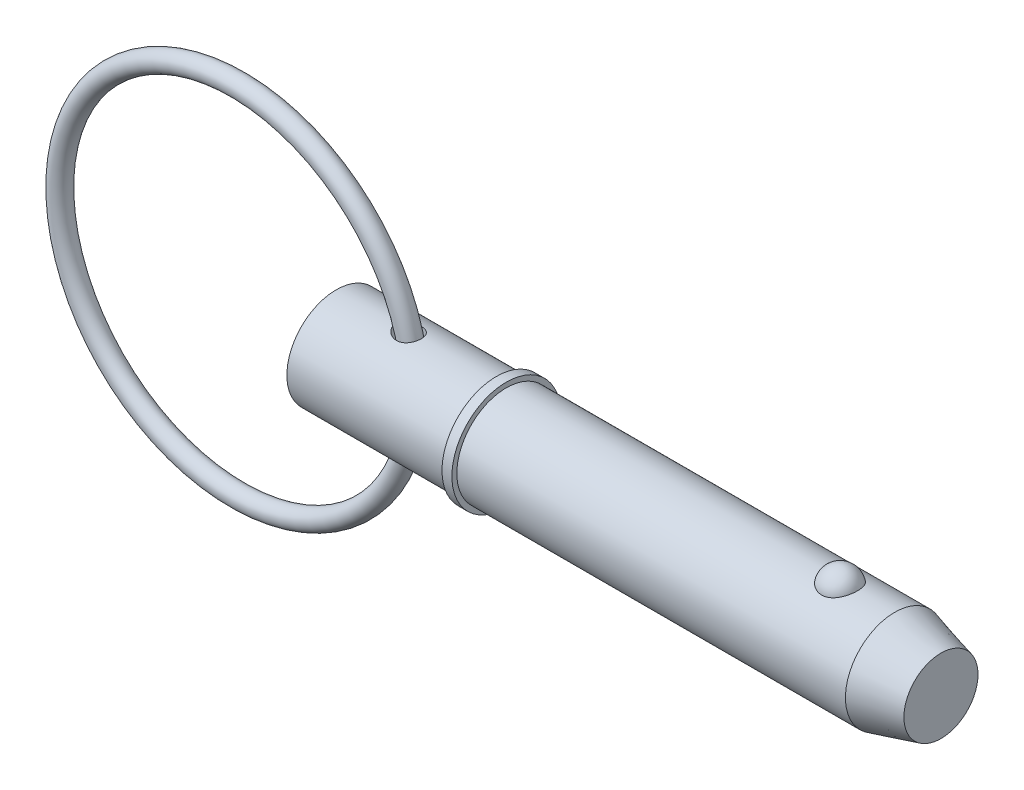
ISO-10303-21;
HEADER;
FILE_DESCRIPTION(('STEP AP214'),'2;1');
FILE_NAME('part.step','',(''),(''),'','','');
FILE_SCHEMA(('AUTOMOTIVE_DESIGN { 1 0 10303 214 1 1 1 1 }'));
ENDSEC;
DATA;
#1=APPLICATION_CONTEXT('core data for automotive mechanical design processes');
#2=APPLICATION_PROTOCOL_DEFINITION('international standard','automotive_design',2000,#1);
#3=PRODUCT_CONTEXT('',#1,'mechanical');
#4=PRODUCT('Part','Part','',(#3));
#5=PRODUCT_RELATED_PRODUCT_CATEGORY('part','',(#4));
#6=PRODUCT_DEFINITION_FORMATION('','',#4);
#7=PRODUCT_DEFINITION_CONTEXT('part definition',#1,'design');
#8=PRODUCT_DEFINITION('design','',#6,#7);
#9=PRODUCT_DEFINITION_SHAPE('','',#8);
#10=(LENGTH_UNIT() NAMED_UNIT(*) SI_UNIT(.MILLI.,.METRE.));
#11=(NAMED_UNIT(*) PLANE_ANGLE_UNIT() SI_UNIT($,.RADIAN.));
#12=(NAMED_UNIT(*) SI_UNIT($,.STERADIAN.) SOLID_ANGLE_UNIT());
#13=UNCERTAINTY_MEASURE_WITH_UNIT(LENGTH_MEASURE(1.E-05),#10,'distance_accuracy_value','');
#14=(GEOMETRIC_REPRESENTATION_CONTEXT(3) GLOBAL_UNCERTAINTY_ASSIGNED_CONTEXT((#13)) GLOBAL_UNIT_ASSIGNED_CONTEXT((#10,
#11,#12)) REPRESENTATION_CONTEXT('',''));
#15=CARTESIAN_POINT('',(0.,0.,0.));
#16=DIRECTION('',(0.,0.,1.));
#17=DIRECTION('',(1.,0.,0.));
#18=AXIS2_PLACEMENT_3D('',#15,#16,#17);
#19=CARTESIAN_POINT('',(-15.855506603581,0.,0.));
#20=DIRECTION('',(0.,0.,1.));
#21=DIRECTION('',(1.,0.,0.));
#22=AXIS2_PLACEMENT_3D('',#19,#20,#21);
#23=TOROIDAL_SURFACE('',#22,28.575,1.588);
#24=CARTESIAN_POINT('',(14.307493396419,0.,0.));
#25=VERTEX_POINT('',#24);
#26=VERTEX_LOOP('',#25);
#27=FACE_BOUND('',#26,.T.);
#28=ADVANCED_FACE('P0_F12',(#27),#23,.T.);
#29=CLOSED_SHELL('',(#28));
#30=MANIFOLD_SOLID_BREP('P0_B1',#29);
#31=CARTESIAN_POINT('',(0.,0.,0.));
#32=DIRECTION('',(1.,0.,0.));
#33=DIRECTION('',(0.,0.,-1.));
#34=AXIS2_PLACEMENT_3D('',#31,#32,#33);
#35=CYLINDRICAL_SURFACE('',#34,7.94);
#36=CARTESIAN_POINT('',(9.9064878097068,7.8609270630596,-1.11777712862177));
#37=CARTESIAN_POINT('',(9.98046148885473,7.84701054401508,-1.21564239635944));
#38=CARTESIAN_POINT('',(10.0632949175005,7.83217804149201,-1.30680329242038));
#39=CARTESIAN_POINT('',(10.243327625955,7.80247884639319,-1.47382688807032));
#40=CARTESIAN_POINT('',(10.3405572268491,7.78761214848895,-1.54965647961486));
#41=CARTESIAN_POINT('',(10.5460150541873,7.75960959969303,-1.6842723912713));
#42=CARTESIAN_POINT('',(10.654212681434,7.74646915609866,-1.74310445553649));
#43=CARTESIAN_POINT('',(10.8789333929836,7.72340979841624,-1.84259563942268));
#44=CARTESIAN_POINT('',(10.9954527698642,7.71348946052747,-1.88326279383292));
#45=CARTESIAN_POINT('',(11.2371543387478,7.69793327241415,-1.94589519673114));
#46=CARTESIAN_POINT('',(11.3624861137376,7.69242163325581,-1.96732022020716));
#47=CARTESIAN_POINT('',(11.6151110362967,7.68708151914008,-1.98809161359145));
#48=CARTESIAN_POINT('',(11.7424035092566,7.68725113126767,-1.98744541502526));
#49=CARTESIAN_POINT('',(11.9871377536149,7.69329740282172,-1.96389977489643));
#50=CARTESIAN_POINT('',(12.1047148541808,7.69883374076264,-1.94232728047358));
#51=CARTESIAN_POINT('',(12.3339179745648,7.7145667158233,-1.87886184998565));
#52=CARTESIAN_POINT('',(12.4455463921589,7.72476145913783,-1.83697717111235));
#53=CARTESIAN_POINT('',(12.6521036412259,7.74778151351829,-1.73721211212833));
#54=CARTESIAN_POINT('',(12.7476463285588,7.76039274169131,-1.68054854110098));
#55=CARTESIAN_POINT('',(12.9274536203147,7.78715828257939,-1.55179691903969));
#56=CARTESIAN_POINT('',(13.0117191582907,7.80131246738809,-1.47971014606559));
#57=CARTESIAN_POINT('',(13.16544092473,7.82932755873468,-1.32341211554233));
#58=CARTESIAN_POINT('',(13.2351086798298,7.84318958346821,-1.23940873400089));
#59=CARTESIAN_POINT('',(13.3595610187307,7.86933512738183,-1.06080152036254));
#60=CARTESIAN_POINT('',(13.4143450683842,7.88161858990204,-0.966197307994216));
#61=CARTESIAN_POINT('',(13.5082288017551,7.90340571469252,-0.767990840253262));
#62=CARTESIAN_POINT('',(13.5471601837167,7.91287927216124,-0.664305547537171));
#63=CARTESIAN_POINT('',(13.6076213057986,7.92785679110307,-0.451705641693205));
#64=CARTESIAN_POINT('',(13.6291504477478,7.93336061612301,-0.3427908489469));
#65=CARTESIAN_POINT('',(13.6544025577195,7.93983472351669,-0.122042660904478));
#66=CARTESIAN_POINT('',(13.6580055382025,7.94077445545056,-0.0101946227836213));
#67=CARTESIAN_POINT('',(13.6469977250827,7.93793630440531,0.212542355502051));
#68=CARTESIAN_POINT('',(13.6323866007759,7.93415833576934,0.323431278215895));
#69=CARTESIAN_POINT('',(13.5852649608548,7.92228583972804,0.541194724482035));
#70=CARTESIAN_POINT('',(13.5527398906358,7.91418780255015,0.648065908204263));
#71=CARTESIAN_POINT('',(13.4705326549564,7.8945509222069,0.854658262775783));
#72=CARTESIAN_POINT('',(13.4208502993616,7.88301204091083,0.954379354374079));
#73=CARTESIAN_POINT('',(13.3056021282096,7.85778224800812,1.14366619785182));
#74=CARTESIAN_POINT('',(13.2400609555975,7.8440946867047,1.23324739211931));
#75=CARTESIAN_POINT('',(13.0946981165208,7.8160855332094,1.39984119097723));
#76=CARTESIAN_POINT('',(13.0148777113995,7.80176399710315,1.47685490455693));
#77=CARTESIAN_POINT('',(12.8438529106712,7.774237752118,1.6154855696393));
#78=CARTESIAN_POINT('',(12.7527554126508,7.76102428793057,1.67723263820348));
#79=CARTESIAN_POINT('',(12.5611987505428,7.73705789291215,1.78453696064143));
#80=CARTESIAN_POINT('',(12.4607407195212,7.72630466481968,1.83009617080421));
#81=CARTESIAN_POINT('',(12.2541997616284,7.70849465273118,1.90371822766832));
#82=CARTESIAN_POINT('',(12.1481665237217,7.7014098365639,1.93191408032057));
#83=CARTESIAN_POINT('',(11.9327851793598,7.69148605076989,1.97105353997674));
#84=CARTESIAN_POINT('',(11.8234367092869,7.68864754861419,1.98199524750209));
#85=CARTESIAN_POINT('',(11.6016024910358,7.68735890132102,1.98698770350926));
#86=CARTESIAN_POINT('',(11.4891069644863,7.68902083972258,1.98060702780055));
#87=CARTESIAN_POINT('',(11.2665484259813,7.6966276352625,1.95083303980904));
#88=CARTESIAN_POINT('',(11.1564861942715,7.70257384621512,1.92743434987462));
#89=CARTESIAN_POINT('',(10.9339966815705,7.71853798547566,1.86251478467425));
#90=CARTESIAN_POINT('',(10.8219140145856,7.72880438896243,1.81987394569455));
#91=CARTESIAN_POINT('',(10.6060441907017,7.75216432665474,1.7176403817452));
#92=CARTESIAN_POINT('',(10.5022611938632,7.76525926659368,1.65803922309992));
#93=CARTESIAN_POINT('',(10.3000447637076,7.79362794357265,1.51929354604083));
#94=CARTESIAN_POINT('',(10.2022480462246,7.80898310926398,1.4392327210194));
#95=CARTESIAN_POINT('',(10.0221668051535,7.83939672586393,1.26310118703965));
#96=CARTESIAN_POINT('',(9.93988168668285,7.85445518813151,1.16703109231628));
#97=CARTESIAN_POINT('',(9.79729823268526,7.88178950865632,0.964874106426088));
#98=CARTESIAN_POINT('',(9.73627994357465,7.89414970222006,0.859310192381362));
#99=CARTESIAN_POINT('',(9.63554001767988,7.91508909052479,0.638143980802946));
#100=CARTESIAN_POINT('',(9.59578986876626,7.92367334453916,0.52255536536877));
#101=CARTESIAN_POINT('',(9.54388714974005,7.93499161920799,0.300466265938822));
#102=CARTESIAN_POINT('',(9.52888458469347,7.93832727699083,0.194660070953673));
#103=CARTESIAN_POINT('',(9.51823078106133,7.94068976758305,-0.0179747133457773));
#104=CARTESIAN_POINT('',(9.52257317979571,7.93971801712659,-0.124802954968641));
#105=CARTESIAN_POINT('',(9.54911264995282,7.93386114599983,-0.326814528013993));
#106=CARTESIAN_POINT('',(9.56976509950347,7.92931471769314,-0.422217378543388));
#107=CARTESIAN_POINT('',(9.62591284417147,7.91721462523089,-0.608271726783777));
#108=CARTESIAN_POINT('',(9.66139801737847,7.90966301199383,-0.698926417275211));
#109=CARTESIAN_POINT('',(9.7317197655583,7.89515389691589,-0.844763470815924));
#110=CARTESIAN_POINT('',(9.76292633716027,7.88881879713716,-0.90180107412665));
#111=CARTESIAN_POINT('',(9.83075962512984,7.87538342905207,-1.01244242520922));
#112=CARTESIAN_POINT('',(9.86738597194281,7.86828321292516,-1.06604640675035));
#113=CARTESIAN_POINT('',(9.9064878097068,7.8609270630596,-1.11777712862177));
#114=B_SPLINE_CURVE_WITH_KNOTS('',3,(#36,#37,#38,#39,#40,#41,#42,#43,#44,#45,#46,#47,#48,#49,
#50,#51,#52,#53,#54,#55,#56,#57,#58,#59,#60,#61,#62,#63,#64,#65,#66,#67,#68,#69,#70,#71,#72,#73,
#74,#75,#76,#77,#78,#79,#80,#81,#82,#83,#84,#85,#86,#87,#88,#89,#90,#91,#92,#93,#94,#95,#96,#97,
#98,#99,#100,#101,#102,#103,#104,#105,#106,#107,#108,#109,#110,#111,#112,#113),.UNSPECIFIED.,
.T.,.F.,(4,2,2,2,2,2,2,2,2,2,2,2,2,2,2,2,2,2,2,2,2,2,2,2,2,2,2,2,2,2,2,2,2,2,2,2,2,2,4),(0.,
0.370138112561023,0.741067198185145,1.11098852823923,1.48074607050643,1.86058657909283,
2.24029919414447,2.59740885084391,2.95437345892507,3.2881332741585,3.62186544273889,
3.95036374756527,4.27887384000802,4.61078596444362,4.94270949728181,5.27685177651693,
5.61100012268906,5.94542035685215,6.27984429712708,6.61375187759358,6.94762997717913,
7.27855592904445,7.60944187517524,7.93776058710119,8.26611544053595,8.60272268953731,
8.93943635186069,9.29895306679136,9.65864886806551,10.0387340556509,10.4188046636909,
10.7843533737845,11.1494107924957,11.4683925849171,11.7872694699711,12.0791172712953,
12.3707662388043,12.5664313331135,12.7620830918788),.UNSPECIFIED.);
#115=CARTESIAN_POINT('',(9.9064878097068,7.8609270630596,-1.11777712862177));
#116=VERTEX_POINT('',#115);
#117=EDGE_CURVE('P1_E42',#116,#116,#114,.T.);
#118=ORIENTED_EDGE('',*,*,#117,.T.);
#119=EDGE_LOOP('',(#118));
#120=FACE_BOUND('',#119,.T.);
#121=CARTESIAN_POINT('',(0.,0.,0.));
#122=DIRECTION('',(1.,0.,0.));
#123=DIRECTION('',(0.,0.,-1.));
#124=AXIS2_PLACEMENT_3D('',#121,#122,#123);
#125=CIRCLE('',#124,7.94);
#126=CARTESIAN_POINT('',(0.,0.,-7.94));
#127=VERTEX_POINT('',#126);
#128=EDGE_CURVE('P1_E9',#127,#127,#125,.T.);
#129=ORIENTED_EDGE('',*,*,#128,.T.);
#130=EDGE_LOOP('',(#129));
#131=FACE_BOUND('',#130,.T.);
#132=CARTESIAN_POINT('',(25.722,0.,0.));
#133=DIRECTION('',(1.,0.,0.));
#134=DIRECTION('',(0.,0.,-1.));
#135=AXIS2_PLACEMENT_3D('',#132,#133,#134);
#136=CIRCLE('',#135,7.94);
#137=CARTESIAN_POINT('',(25.722,0.,-7.94));
#138=VERTEX_POINT('',#137);
#139=EDGE_CURVE('P1_E25',#138,#138,#136,.T.);
#140=ORIENTED_EDGE('',*,*,#139,.F.);
#141=EDGE_LOOP('',(#140));
#142=FACE_BOUND('',#141,.T.);
#143=CARTESIAN_POINT('',(9.9064878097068,-7.8609270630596,-1.11777712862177));
#144=CARTESIAN_POINT('',(9.84378768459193,-7.87272256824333,-1.03482250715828));
#145=CARTESIAN_POINT('',(9.7874122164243,-7.88386682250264,-0.947002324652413));
#146=CARTESIAN_POINT('',(9.68947008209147,-7.90377389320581,-0.763202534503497));
#147=CARTESIAN_POINT('',(9.64789384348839,-7.91253824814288,-0.667228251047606));
#148=CARTESIAN_POINT('',(9.58141396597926,-7.92676779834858,-0.46889851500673));
#149=CARTESIAN_POINT('',(9.55658638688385,-7.93221793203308,-0.36651622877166));
#150=CARTESIAN_POINT('',(9.525398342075,-7.9390896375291,-0.158837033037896));
#151=CARTESIAN_POINT('',(9.51903196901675,-7.94051249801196,-0.0535410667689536));
#152=CARTESIAN_POINT('',(9.5249639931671,-7.93919670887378,0.149856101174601));
#153=CARTESIAN_POINT('',(9.53611757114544,-7.9367132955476,0.24799461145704));
#154=CARTESIAN_POINT('',(9.57435037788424,-7.92833496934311,0.44094918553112));
#155=CARTESIAN_POINT('',(9.60143086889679,-7.92243978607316,0.535764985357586));
#156=CARTESIAN_POINT('',(9.67027872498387,-7.90782830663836,0.720026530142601));
#157=CARTESIAN_POINT('',(9.71210005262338,-7.89910165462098,0.809451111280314));
#158=CARTESIAN_POINT('',(9.80864905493,-7.87966534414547,0.980775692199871));
#159=CARTESIAN_POINT('',(9.86338092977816,-7.86895504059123,1.06267323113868));
#160=CARTESIAN_POINT('',(9.99009906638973,-7.84531573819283,1.22559225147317));
#161=CARTESIAN_POINT('',(10.0632770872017,-7.8322718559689,1.30566871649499));
#162=CARTESIAN_POINT('',(10.2208237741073,-7.80611237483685,1.45392159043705));
#163=CARTESIAN_POINT('',(10.3051986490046,-7.79299674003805,1.52209134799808));
#164=CARTESIAN_POINT('',(10.4935539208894,-7.76638841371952,1.65280871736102));
#165=CARTESIAN_POINT('',(10.5986730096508,-7.75303312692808,1.71374951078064));
#166=CARTESIAN_POINT('',(10.8175805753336,-7.72920597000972,1.81820073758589));
#167=CARTESIAN_POINT('',(10.9313721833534,-7.71873514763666,1.86170483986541));
#168=CARTESIAN_POINT('',(11.1696833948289,-7.70161777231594,1.93133079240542));
#169=CARTESIAN_POINT('',(11.2944525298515,-7.69514907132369,1.95665138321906));
#170=CARTESIAN_POINT('',(11.5466607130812,-7.6877908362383,1.98537345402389));
#171=CARTESIAN_POINT('',(11.6740986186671,-7.68689896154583,1.98878412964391));
#172=CARTESIAN_POINT('',(11.9206005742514,-7.690938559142,1.97309854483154));
#173=CARTESIAN_POINT('',(12.0397453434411,-7.69555832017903,1.95520713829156));
#174=CARTESIAN_POINT('',(12.2727177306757,-7.70968728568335,1.89872693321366));
#175=CARTESIAN_POINT('',(12.3865475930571,-7.71919440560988,1.86014695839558));
#176=CARTESIAN_POINT('',(12.5975118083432,-7.74115679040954,1.76641559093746));
#177=CARTESIAN_POINT('',(12.6952552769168,-7.75336701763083,1.71257254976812));
#178=CARTESIAN_POINT('',(12.8798510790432,-7.77962828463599,1.58901145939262));
#179=CARTESIAN_POINT('',(12.9667044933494,-7.79367914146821,1.51929498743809));
#180=CARTESIAN_POINT('',(13.1254818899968,-7.82172079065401,1.36751778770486));
#181=CARTESIAN_POINT('',(13.1976693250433,-7.83570718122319,1.28573131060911));
#182=CARTESIAN_POINT('',(13.3274495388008,-7.86236718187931,1.11111271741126));
#183=CARTESIAN_POINT('',(13.3850418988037,-7.87504075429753,1.01828028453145));
#184=CARTESIAN_POINT('',(13.4847470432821,-7.89782512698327,0.823214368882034));
#185=CARTESIAN_POINT('',(13.5267056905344,-7.90791011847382,0.72089908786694));
#186=CARTESIAN_POINT('',(13.5933891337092,-7.92427335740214,0.510509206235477));
#187=CARTESIAN_POINT('',(13.6181132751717,-7.9305514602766,0.40243438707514));
#188=CARTESIAN_POINT('',(13.6498843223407,-7.93866355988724,0.182728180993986));
#189=CARTESIAN_POINT('',(13.6567982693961,-7.94046412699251,0.0710763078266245));
#190=CARTESIAN_POINT('',(13.6524060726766,-7.93933046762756,-0.151845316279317));
#191=CARTESIAN_POINT('',(13.6410996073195,-7.93639615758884,-0.263115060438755));
#192=CARTESIAN_POINT('',(13.6005023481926,-7.92610202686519,-0.482238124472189));
#193=CARTESIAN_POINT('',(13.571192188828,-7.91873744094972,-0.590087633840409));
#194=CARTESIAN_POINT('',(13.495246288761,-7.90037565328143,-0.799178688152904));
#195=CARTESIAN_POINT('',(13.4486102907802,-7.88937839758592,-0.900420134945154));
#196=CARTESIAN_POINT('',(13.3391817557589,-7.86497175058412,-1.09328280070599));
#197=CARTESIAN_POINT('',(13.2764083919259,-7.85156522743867,-1.18491525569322));
#198=CARTESIAN_POINT('',(13.1362355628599,-7.8238261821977,-1.35604994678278));
#199=CARTESIAN_POINT('',(13.0588372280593,-7.80949373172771,-1.43555311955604));
#200=CARTESIAN_POINT('',(12.8921392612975,-7.78164292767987,-1.57955181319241));
#201=CARTESIAN_POINT('',(12.8029410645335,-7.76811892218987,-1.64416363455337));
#202=CARTESIAN_POINT('',(12.6146622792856,-7.74328422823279,-1.75742016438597));
#203=CARTESIAN_POINT('',(12.5155829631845,-7.73197325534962,-1.80606692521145));
#204=CARTESIAN_POINT('',(12.31135301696,-7.71289290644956,-1.88588502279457));
#205=CARTESIAN_POINT('',(12.2062651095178,-7.70509254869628,-1.91720981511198));
#206=CARTESIAN_POINT('',(11.9922253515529,-7.69365188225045,-1.96261878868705));
#207=CARTESIAN_POINT('',(11.8832731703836,-7.69001193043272,-1.97670149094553));
#208=CARTESIAN_POINT('',(11.662174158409,-7.6871142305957,-1.98794112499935));
#209=CARTESIAN_POINT('',(11.5500082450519,-7.6879499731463,-1.98473694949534));
#210=CARTESIAN_POINT('',(11.3276038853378,-7.69396349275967,-1.96129119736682));
#211=CARTESIAN_POINT('',(11.2173659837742,-7.6991424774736,-1.94104488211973));
#212=CARTESIAN_POINT('',(10.9943151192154,-7.71363470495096,-1.8826578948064));
#213=CARTESIAN_POINT('',(10.8818004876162,-7.72319478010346,-1.8434396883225));
#214=CARTESIAN_POINT('',(10.6644693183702,-7.74534199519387,-1.74804607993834));
#215=CARTESIAN_POINT('',(10.5596578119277,-7.75793109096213,-1.69185971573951));
#216=CARTESIAN_POINT('',(10.3538333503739,-7.78563853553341,-1.55958016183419));
#217=CARTESIAN_POINT('',(10.2535123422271,-7.80086820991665,-1.48242881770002));
#218=CARTESIAN_POINT('',(10.0678634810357,-7.83136022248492,-1.31182139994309));
#219=CARTESIAN_POINT('',(9.98252491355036,-7.84662252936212,-1.21837707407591));
#220=CARTESIAN_POINT('',(9.9064878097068,-7.8609270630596,-1.11777712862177));
#221=B_SPLINE_CURVE_WITH_KNOTS('',3,(#143,#144,#145,#146,#147,#148,#149,#150,#151,#152,#153,
#154,#155,#156,#157,#158,#159,#160,#161,#162,#163,#164,#165,#166,#167,#168,#169,#170,#171,#172,
#173,#174,#175,#176,#177,#178,#179,#180,#181,#182,#183,#184,#185,#186,#187,#188,#189,#190,#191,
#192,#193,#194,#195,#196,#197,#198,#199,#200,#201,#202,#203,#204,#205,#206,#207,#208,#209,#210,
#211,#212,#213,#214,#215,#216,#217,#218,#219,#220),.UNSPECIFIED.,.T.,.F.,(4,2,2,2,2,2,2,2,2,2,2,
2,2,2,2,2,2,2,2,2,2,2,2,2,2,2,2,2,2,2,2,2,2,2,2,2,2,2,4),(0.,0.313593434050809,
0.626983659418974,0.941787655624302,1.25649090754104,1.55146990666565,1.84647228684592,
2.14256601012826,2.43875619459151,2.76521830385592,3.09186220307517,3.45696288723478,
3.82219601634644,4.20267276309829,4.58298981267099,4.94277962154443,5.30241610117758,
5.63754619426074,5.9726430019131,6.30104941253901,6.62946524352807,6.96103833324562,
7.29262401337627,7.62667800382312,7.96073789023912,8.29515773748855,8.62958255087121,
8.96361184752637,9.29761533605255,9.62891449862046,9.96017105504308,10.288443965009,
10.616745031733,10.951930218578,11.2872086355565,11.6442788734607,12.0015802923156,
12.3821516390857,12.762449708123),.UNSPECIFIED.);
#222=CARTESIAN_POINT('',(9.9064878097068,-7.8609270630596,-1.11777712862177));
#223=VERTEX_POINT('',#222);
#224=EDGE_CURVE('P1_E17',#223,#223,#221,.T.);
#225=ORIENTED_EDGE('',*,*,#224,.T.);
#226=EDGE_LOOP('',(#225));
#227=FACE_BOUND('',#226,.T.);
#228=ADVANCED_FACE('P1_F13',(#120,#131,#142,#227),#35,.T.);
#229=CARTESIAN_POINT('',(0.,0.,0.));
#230=DIRECTION('',(1.,0.,0.));
#231=DIRECTION('',(0.,0.,-1.));
#232=AXIS2_PLACEMENT_3D('',#229,#230,#231);
#233=CYLINDRICAL_SURFACE('',#232,7.94);
#234=CARTESIAN_POINT('',(89.7518791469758,0.,0.));
#235=DIRECTION('',(1.,0.,0.));
#236=DIRECTION('',(0.,0.,-1.));
#237=AXIS2_PLACEMENT_3D('',#234,#235,#236);
#238=CIRCLE('',#237,7.94);
#239=CARTESIAN_POINT('',(89.7518791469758,0.,-7.94));
#240=VERTEX_POINT('',#239);
#241=EDGE_CURVE('P1_E99',#240,#240,#238,.T.);
#242=ORIENTED_EDGE('',*,*,#241,.F.);
#243=EDGE_LOOP('',(#242));
#244=FACE_BOUND('',#243,.T.);
#245=CARTESIAN_POINT('',(27.31,0.,0.));
#246=DIRECTION('',(1.,0.,0.));
#247=DIRECTION('',(0.,0.,-1.));
#248=AXIS2_PLACEMENT_3D('',#245,#246,#247);
#249=CIRCLE('',#248,7.94);
#250=CARTESIAN_POINT('',(27.31,0.,-7.94));
#251=VERTEX_POINT('',#250);
#252=EDGE_CURVE('P1_E96',#251,#251,#249,.T.);
#253=ORIENTED_EDGE('',*,*,#252,.T.);
#254=EDGE_LOOP('',(#253));
#255=FACE_BOUND('',#254,.T.);
#256=CARTESIAN_POINT('',(80.9449074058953,7.37767842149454,2.93486986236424));
#257=CARTESIAN_POINT('',(80.7927496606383,7.37767329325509,2.9348750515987));
#258=CARTESIAN_POINT('',(80.6406329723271,7.38258419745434,2.92262454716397));
#259=CARTESIAN_POINT('',(80.3409284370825,7.40163229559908,2.87404196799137));
#260=CARTESIAN_POINT('',(80.1933394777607,7.41576720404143,2.83771585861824));
#261=CARTESIAN_POINT('',(79.9070187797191,7.45161576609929,2.74218769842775));
#262=CARTESIAN_POINT('',(79.7682745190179,7.47331841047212,2.68301886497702));
#263=CARTESIAN_POINT('',(79.5028822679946,7.52194082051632,2.54350967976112));
#264=CARTESIAN_POINT('',(79.3762366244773,7.54886159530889,2.46316523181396));
#265=CARTESIAN_POINT('',(79.1345349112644,7.60594671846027,2.28090375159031));
#266=CARTESIAN_POINT('',(79.0199065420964,7.63618114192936,2.17844211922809));
#267=CARTESIAN_POINT('',(78.8088787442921,7.69614046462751,1.95608495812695));
#268=CARTESIAN_POINT('',(78.7124826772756,7.72586526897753,1.83618622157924));
#269=CARTESIAN_POINT('',(78.5359381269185,7.78314821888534,1.57628086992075));
#270=CARTESIAN_POINT('',(78.4567072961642,7.81055035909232,1.43561546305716));
#271=CARTESIAN_POINT('',(78.3217979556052,7.85879631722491,1.14236334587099));
#272=CARTESIAN_POINT('',(78.2661216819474,7.87963951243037,0.989775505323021));
#273=CARTESIAN_POINT('',(78.1788121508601,7.91289645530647,0.674619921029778));
#274=CARTESIAN_POINT('',(78.1475309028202,7.925186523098,0.511941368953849));
#275=CARTESIAN_POINT('',(78.110975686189,7.93958930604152,0.183247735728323));
#276=CARTESIAN_POINT('',(78.1057012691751,7.94170219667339,0.0172327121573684));
#277=CARTESIAN_POINT('',(78.1212311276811,7.93554931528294,-0.312672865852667));
#278=CARTESIAN_POINT('',(78.1419253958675,7.92732732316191,-0.476569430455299));
#279=CARTESIAN_POINT('',(78.2087865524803,7.90141534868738,-0.798305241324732));
#280=CARTESIAN_POINT('',(78.2549539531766,7.88372517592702,-0.956144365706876));
#281=CARTESIAN_POINT('',(78.3718986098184,7.84066230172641,-1.26152073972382));
#282=CARTESIAN_POINT('',(78.4427046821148,7.81528060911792,-1.40904568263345));
#283=CARTESIAN_POINT('',(78.6074789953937,7.7594867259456,-1.68950598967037));
#284=CARTESIAN_POINT('',(78.7014488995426,7.72907417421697,-1.82244030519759));
#285=CARTESIAN_POINT('',(78.9108391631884,7.66640424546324,-2.07032792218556));
#286=CARTESIAN_POINT('',(79.0263152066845,7.63414223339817,-2.18523308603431));
#287=CARTESIAN_POINT('',(79.2759006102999,7.57149681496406,-2.39329737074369));
#288=CARTESIAN_POINT('',(79.4100080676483,7.54111321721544,-2.48645870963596));
#289=CARTESIAN_POINT('',(79.6901113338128,7.48650742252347,-2.64628132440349));
#290=CARTESIAN_POINT('',(79.8357605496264,7.46215900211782,-2.71350554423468));
#291=CARTESIAN_POINT('',(80.1374259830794,7.42171253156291,-2.82226614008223));
#292=CARTESIAN_POINT('',(80.2934383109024,7.40561140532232,-2.86381209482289));
#293=CARTESIAN_POINT('',(80.6029708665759,7.3842679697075,-2.91839077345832));
#294=CARTESIAN_POINT('',(80.7562229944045,7.37852109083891,-2.93275024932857));
#295=CARTESIAN_POINT('',(81.0630705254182,7.37700973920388,-2.93655208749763));
#296=CARTESIAN_POINT('',(81.2166658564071,7.38124333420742,-2.92599927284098));
#297=CARTESIAN_POINT('',(81.5149907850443,7.39890635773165,-2.88102897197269));
#298=CARTESIAN_POINT('',(81.6598480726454,7.41205491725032,-2.84733999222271));
#299=CARTESIAN_POINT('',(81.9416432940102,7.44580110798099,-2.75788206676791));
#300=CARTESIAN_POINT('',(82.0785805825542,7.46639934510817,-2.7021113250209));
#301=CARTESIAN_POINT('',(82.3440619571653,7.51339098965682,-2.56858908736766));
#302=CARTESIAN_POINT('',(82.4723548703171,7.53990200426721,-2.49038067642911));
#303=CARTESIAN_POINT('',(82.7142440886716,7.59569503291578,-2.31462737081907));
#304=CARTESIAN_POINT('',(82.8278370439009,7.6249776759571,-2.21707808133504));
#305=CARTESIAN_POINT('',(83.04322156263,7.68489473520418,-1.99982049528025));
#306=CARTESIAN_POINT('',(83.1441488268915,7.71552419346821,-1.87925337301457));
#307=CARTESIAN_POINT('',(83.3251866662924,7.77353016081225,-1.62268826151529));
#308=CARTESIAN_POINT('',(83.4052934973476,7.80090608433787,-1.48668750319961));
#309=CARTESIAN_POINT('',(83.5453615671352,7.85047992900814,-1.19818413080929));
#310=CARTESIAN_POINT('',(83.6045877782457,7.8724818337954,-1.04529016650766));
#311=CARTESIAN_POINT('',(83.6979821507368,7.90785114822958,-0.73108000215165));
#312=CARTESIAN_POINT('',(83.7321497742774,7.92121837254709,-0.569763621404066));
#313=CARTESIAN_POINT('',(83.774795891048,7.93797834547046,-0.242812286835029));
#314=CARTESIAN_POINT('',(83.7832047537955,7.94134405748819,-0.077166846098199));
#315=CARTESIAN_POINT('',(83.7739626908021,7.93767937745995,0.253276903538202));
#316=CARTESIAN_POINT('',(83.7563120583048,7.93064910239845,0.418075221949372));
#317=CARTESIAN_POINT('',(83.695424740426,7.90695571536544,0.741525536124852));
#318=CARTESIAN_POINT('',(83.6522819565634,7.8903279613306,0.90019782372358));
#319=CARTESIAN_POINT('',(83.5413535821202,7.84916386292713,1.20759654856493));
#320=CARTESIAN_POINT('',(83.47356656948,7.82462706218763,1.35632241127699));
#321=CARTESIAN_POINT('',(83.3143718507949,7.7700669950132,1.64032869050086));
#322=CARTESIAN_POINT('',(83.2228616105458,7.7400200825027,1.77554712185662));
#323=CARTESIAN_POINT('',(83.0182960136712,7.67774175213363,2.02800648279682));
#324=CARTESIAN_POINT('',(82.9052410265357,7.64551037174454,2.1452477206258));
#325=CARTESIAN_POINT('',(82.6608318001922,7.58265895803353,2.35778002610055));
#326=CARTESIAN_POINT('',(82.5295833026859,7.55203092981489,2.45319004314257));
#327=CARTESIAN_POINT('',(82.251601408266,7.49579792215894,2.61999897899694));
#328=CARTESIAN_POINT('',(82.1048670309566,7.47019326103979,2.6913963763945));
#329=CARTESIAN_POINT('',(81.7929477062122,7.42622216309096,2.81053241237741));
#330=CARTESIAN_POINT('',(81.6272209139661,7.40825002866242,2.85700910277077));
#331=CARTESIAN_POINT('',(81.2892792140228,7.38398348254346,2.91916850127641));
#332=CARTESIAN_POINT('',(81.1170670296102,7.3776842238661,2.93486399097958));
#333=CARTESIAN_POINT('',(80.9449074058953,7.37767842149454,2.93486986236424));
#334=B_SPLINE_CURVE_WITH_KNOTS('',3,(#256,#257,#258,#259,#260,#261,#262,#263,#264,#265,#266,
#267,#268,#269,#270,#271,#272,#273,#274,#275,#276,#277,#278,#279,#280,#281,#282,#283,#284,#285,
#286,#287,#288,#289,#290,#291,#292,#293,#294,#295,#296,#297,#298,#299,#300,#301,#302,#303,#304,
#305,#306,#307,#308,#309,#310,#311,#312,#313,#314,#315,#316,#317,#318,#319,#320,#321,#322,#323,
#324,#325,#326,#327,#328,#329,#330,#331,#332,#333),.UNSPECIFIED.,.T.,.F.,(4,2,2,2,2,2,2,2,2,2,2,
2,2,2,2,2,2,2,2,2,2,2,2,2,2,2,2,2,2,2,2,2,2,2,2,2,2,2,4),(0.,0.45584132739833,0.911569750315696,
1.36663794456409,1.82179423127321,2.28978983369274,2.75787163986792,3.24685368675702,
3.73588214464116,4.23184282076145,4.72779494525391,5.22165321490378,5.71552141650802,
6.20996917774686,6.70445245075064,7.20023431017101,7.69596557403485,8.18023418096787,
8.6643220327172,9.12410697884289,9.58380291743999,10.0296503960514,10.475534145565,
10.9312349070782,11.3870393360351,11.8654416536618,12.3439299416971,12.8378875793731,
13.3318558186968,13.8271581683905,14.3224549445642,14.8159385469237,15.3094506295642,
15.8051323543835,16.3008055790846,16.7937101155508,17.2866458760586,17.8026240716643,
18.3183879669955),.UNSPECIFIED.);
#335=CARTESIAN_POINT('',(80.9449074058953,7.37767842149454,2.93486986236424));
#336=VERTEX_POINT('',#335);
#337=EDGE_CURVE('P1_E34',#336,#336,#334,.T.);
#338=ORIENTED_EDGE('',*,*,#337,.T.);
#339=EDGE_LOOP('',(#338));
#340=FACE_BOUND('',#339,.T.);
#341=ADVANCED_FACE('P1_F46',(#244,#255,#340),#233,.T.);
#342=CARTESIAN_POINT('',(0.,0.,0.));
#343=DIRECTION('',(-1.,0.,0.));
#344=DIRECTION('',(0.,0.,1.));
#345=AXIS2_PLACEMENT_3D('',#342,#343,#344);
#346=PLANE('',#345);
#347=ORIENTED_EDGE('',*,*,#128,.F.);
#348=EDGE_LOOP('',(#347));
#349=FACE_BOUND('',#348,.T.);
#350=ADVANCED_FACE('P1_F15',(#349),#346,.T.);
#351=CARTESIAN_POINT('',(25.722,7.94,0.));
#352=DIRECTION('',(-1.,0.,0.));
#353=DIRECTION('',(0.,0.,1.));
#354=AXIS2_PLACEMENT_3D('',#351,#352,#353);
#355=PLANE('',#354);
#356=ORIENTED_EDGE('',*,*,#139,.T.);
#357=EDGE_LOOP('',(#356));
#358=FACE_BOUND('',#357,.T.);
#359=CARTESIAN_POINT('',(25.722,0.,0.));
#360=DIRECTION('',(1.,0.,0.));
#361=DIRECTION('',(0.,0.,-1.));
#362=AXIS2_PLACEMENT_3D('',#359,#360,#361);
#363=CIRCLE('',#362,8.734);
#364=CARTESIAN_POINT('',(25.722,0.,-8.734));
#365=VERTEX_POINT('',#364);
#366=EDGE_CURVE('P1_E30',#365,#365,#363,.T.);
#367=ORIENTED_EDGE('',*,*,#366,.F.);
#368=EDGE_LOOP('',(#367));
#369=FACE_BOUND('',#368,.T.);
#370=ADVANCED_FACE('P1_F81',(#358,#369),#355,.T.);
#371=CARTESIAN_POINT('',(0.,0.,0.));
#372=DIRECTION('',(1.,0.,0.));
#373=DIRECTION('',(0.,0.,-1.));
#374=AXIS2_PLACEMENT_3D('',#371,#372,#373);
#375=CYLINDRICAL_SURFACE('',#374,8.734);
#376=ORIENTED_EDGE('',*,*,#366,.T.);
#377=EDGE_LOOP('',(#376));
#378=FACE_BOUND('',#377,.T.);
#379=CARTESIAN_POINT('',(27.31,0.,0.));
#380=DIRECTION('',(1.,0.,0.));
#381=DIRECTION('',(0.,0.,-1.));
#382=AXIS2_PLACEMENT_3D('',#379,#380,#381);
#383=CIRCLE('',#382,8.734);
#384=CARTESIAN_POINT('',(27.31,0.,-8.734));
#385=VERTEX_POINT('',#384);
#386=EDGE_CURVE('P1_E95',#385,#385,#383,.T.);
#387=ORIENTED_EDGE('',*,*,#386,.F.);
#388=EDGE_LOOP('',(#387));
#389=FACE_BOUND('',#388,.T.);
#390=ADVANCED_FACE('P1_F68',(#378,#389),#375,.T.);
#391=CARTESIAN_POINT('',(27.31,8.734,0.));
#392=DIRECTION('',(1.,0.,0.));
#393=DIRECTION('',(0.,0.,-1.));
#394=AXIS2_PLACEMENT_3D('',#391,#392,#393);
#395=PLANE('',#394);
#396=ORIENTED_EDGE('',*,*,#386,.T.);
#397=EDGE_LOOP('',(#396));
#398=FACE_BOUND('',#397,.T.);
#399=ORIENTED_EDGE('',*,*,#252,.F.);
#400=EDGE_LOOP('',(#399));
#401=FACE_BOUND('',#400,.T.);
#402=ADVANCED_FACE('P1_F62',(#398,#401),#395,.T.);
#403=CARTESIAN_POINT('',(97.16,0.,0.));
#404=DIRECTION('',(-1.,0.,0.));
#405=DIRECTION('',(0.,0.,1.));
#406=AXIS2_PLACEMENT_3D('',#403,#404,#405);
#407=CONICAL_SURFACE('',#406,5.95500000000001,0.26179938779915);
#408=ORIENTED_EDGE('',*,*,#241,.T.);
#409=EDGE_LOOP('',(#408));
#410=FACE_BOUND('',#409,.T.);
#411=CARTESIAN_POINT('',(97.16,0.,0.));
#412=DIRECTION('',(1.,0.,0.));
#413=DIRECTION('',(0.,0.,-1.));
#414=AXIS2_PLACEMENT_3D('',#411,#412,#413);
#415=CIRCLE('',#414,5.95500000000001);
#416=CARTESIAN_POINT('',(97.16,0.,-5.95500000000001));
#417=VERTEX_POINT('',#416);
#418=EDGE_CURVE('P1_E41',#417,#417,#415,.T.);
#419=ORIENTED_EDGE('',*,*,#418,.F.);
#420=EDGE_LOOP('',(#419));
#421=FACE_BOUND('',#420,.T.);
#422=ADVANCED_FACE('P1_F59',(#410,#421),#407,.T.);
#423=CARTESIAN_POINT('',(97.16,5.95500000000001,0.));
#424=DIRECTION('',(1.,0.,0.));
#425=DIRECTION('',(0.,0.,-1.));
#426=AXIS2_PLACEMENT_3D('',#423,#424,#425);
#427=PLANE('',#426);
#428=ORIENTED_EDGE('',*,*,#418,.T.);
#429=EDGE_LOOP('',(#428));
#430=FACE_BOUND('',#429,.T.);
#431=ADVANCED_FACE('P1_F55',(#430),#427,.T.);
#432=CARTESIAN_POINT('',(80.9449074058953,7.14599999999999,0.));
#433=DIRECTION('',(-1.,0.,0.));
#434=DIRECTION('',(0.,-1.,0.));
#435=AXIS2_PLACEMENT_3D('',#432,#433,#434);
#436=SPHERICAL_SURFACE('',#435,2.94400000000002);
#437=ORIENTED_EDGE('',*,*,#337,.F.);
#438=EDGE_LOOP('',(#437));
#439=FACE_BOUND('',#438,.T.);
#440=ADVANCED_FACE('P1_F50',(#439),#436,.T.);
#441=CARTESIAN_POINT('',(-15.855506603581,0.,0.));
#442=DIRECTION('',(0.,0.,1.));
#443=DIRECTION('',(1.,0.,0.));
#444=AXIS2_PLACEMENT_3D('',#441,#442,#443);
#445=TOROIDAL_SURFACE('',#444,28.575,1.985);
#446=ORIENTED_EDGE('',*,*,#224,.F.);
#447=EDGE_LOOP('',(#446));
#448=FACE_BOUND('',#447,.T.);
#449=ORIENTED_EDGE('',*,*,#117,.F.);
#450=EDGE_LOOP('',(#449));
#451=FACE_BOUND('',#450,.T.);
#452=ADVANCED_FACE('P1_F54',(#448,#451),#445,.F.);
#453=CLOSED_SHELL('',(#228,#341,#350,#370,#390,#402,#422,#431,#440,#452));
#454=MANIFOLD_SOLID_BREP('P1_B1',#453);
#455=ADVANCED_BREP_SHAPE_REPRESENTATION('',(#18,#30,#454),#14);
#456=SHAPE_DEFINITION_REPRESENTATION(#9,#455);
ENDSEC;
END-ISO-10303-21;
